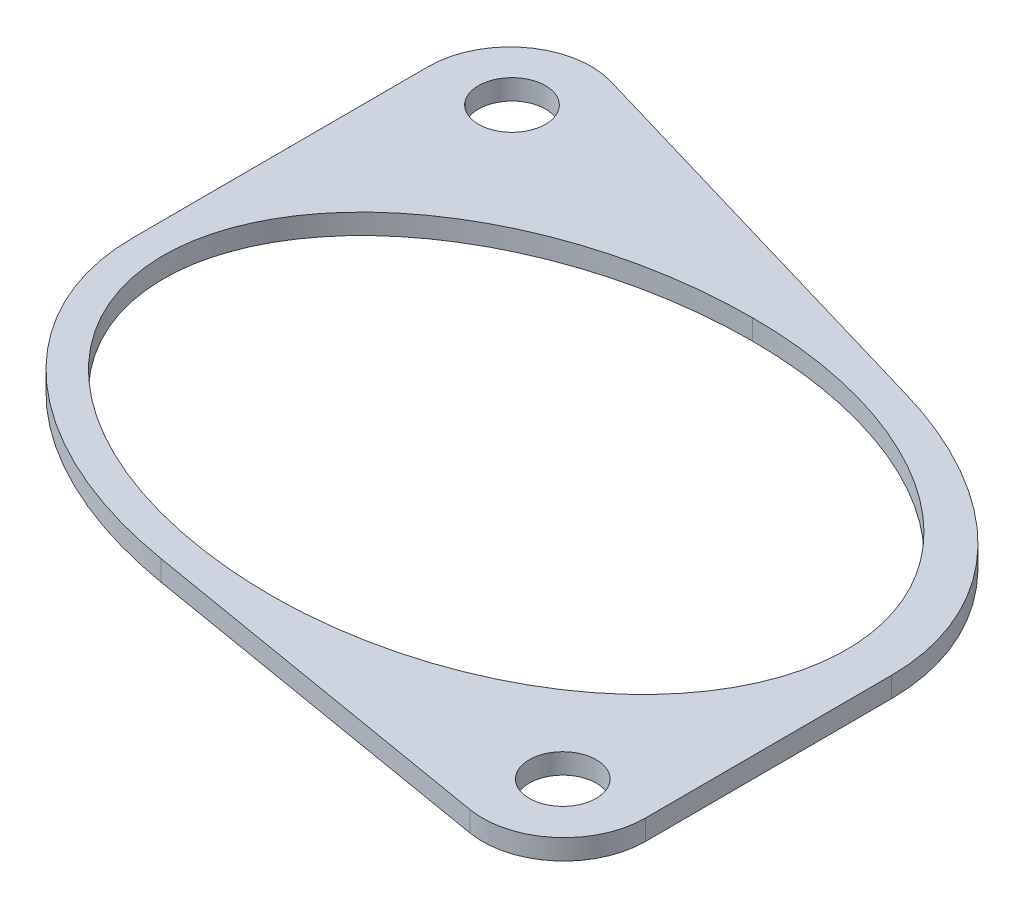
from build123d import *

# Parameters (mm, degrees)
SKETCH1_R           = 1.65
BOSS_EXTRUDE1_DEPTH = 1
FILLET1_R           = 4


with BuildPart() as part:
    # Sketch1 → Boss-Extrude1 (new body)
    with BuildSketch(Plane(origin=(0, 0, 0), x_dir=(1, 0, 0), z_dir=(0, 1, 0))):
        with BuildLine():
            Line((7.111633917, 12.343558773), (-18.709903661, 19.950061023))
            Line((-18.709903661, 19.950061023), (-18.670019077, -3.8e-08))
            Line((-18.670019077, -3.8e-08), (-18.669980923, -0.019084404))
            add(Edge.make_bspline(
                [(-18.669980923, -0.019084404), (-18.648894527, -10.566389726), (-4.293858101, -12.992135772)],
                knots=[3.143134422, 3.143134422, 3.143134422, 4.480324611, 4.480324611, 4.480324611], degree=2, weights=[0.99950355, 0.784463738, 1]))
            Line((-4.293858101, -12.992135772), (18.710515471, -16.879466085))
            Line((18.710515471, -16.879466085), (18.669972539, 0.022897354))
            add(Edge.make_bspline(
                [(18.669972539, 0.022897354), (18.648571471, 8.945010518), (7.111633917, 12.343558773)],
                knots=[0.001715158, 0.001715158, 0.001715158, 1.164506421, 1.164506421, 1.164506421], degree=2, weights=[1, 0.783396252, 0.887827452]))
        make_face()
        with BuildLine():
            add(Edge.make_bspline(
                [(0, 11.85), (-17.17, 11.85), (-17.17, 0), (-17.17, -11.85), (0, -11.85)],
                knots=[4.71238898, 4.71238898, 4.71238898, 6.283185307, 6.283185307, 7.853981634, 7.853981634, 7.853981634], degree=2, weights=[1, 0.707106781, 1, 0.707106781, 1]))
            add(Edge.make_bspline(
                [(0, -11.85), (16.47, -11.85), (16.47, 0), (16.47, 11.85), (0, 11.85)],
                knots=[4.71238898, 4.71238898, 4.71238898, 6.283185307, 6.283185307, 7.853981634, 7.853981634, 7.853981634], degree=2, weights=[1, 0.707106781, 1, 0.707106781, 1]))
        make_face(mode=Mode.SUBTRACT)
        with Locations(Location((15, -12.5, 0), (0, 0, 270))):
            Circle(SKETCH1_R, mode=Mode.SUBTRACT)
        with Locations(Location((-15, 15, 0), (0, 0, 270))):
            Circle(SKETCH1_R, mode=Mode.SUBTRACT)
    extrude(amount=BOSS_EXTRUDE1_DEPTH)

    # Fillet1
    fillet1_edges = [part.edges().sort_by_distance(p)[0] for p in [
        (-18.709903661, 0.5, -19.950061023),
        (18.710515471, 0.5, 16.879466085),
    ]]
    fillet(fillet1_edges, radius=FILLET1_R)


solid = part.part
